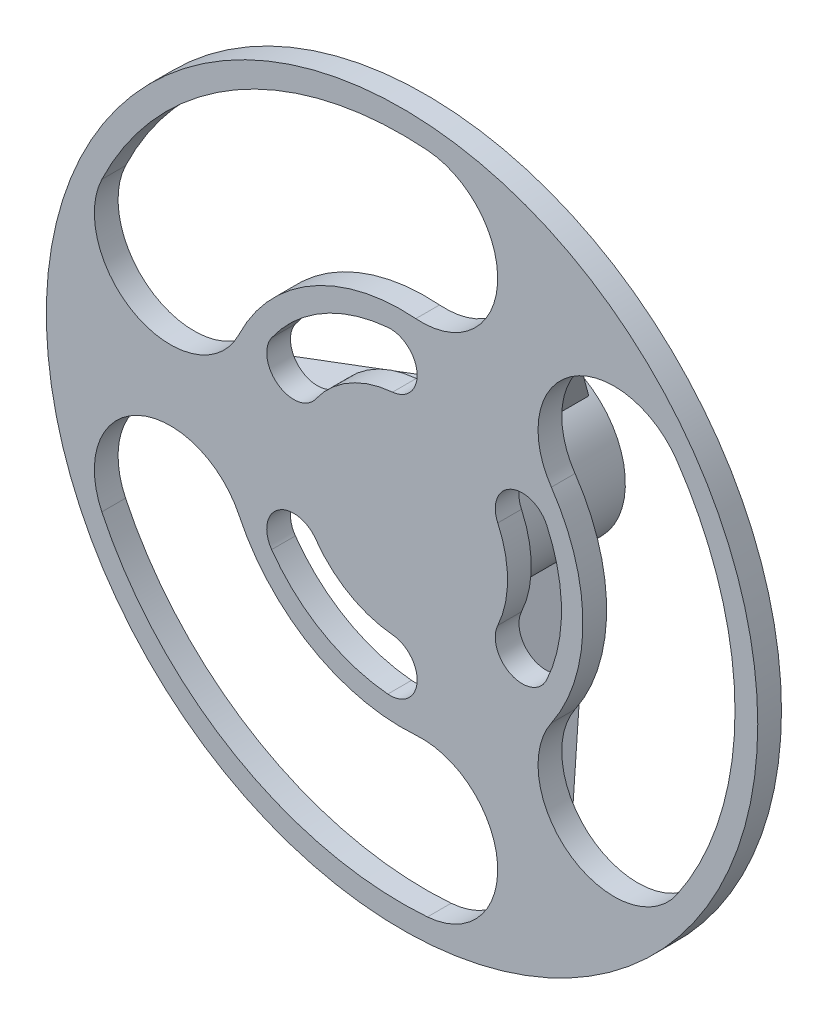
ISO-10303-21;
HEADER;
FILE_DESCRIPTION(('STEP AP214'),'2;1');
FILE_NAME('part.step','',(''),(''),'','','');
FILE_SCHEMA(('AUTOMOTIVE_DESIGN { 1 0 10303 214 1 1 1 1 }'));
ENDSEC;
DATA;
#1=APPLICATION_CONTEXT('core data for automotive mechanical design processes');
#2=APPLICATION_PROTOCOL_DEFINITION('international standard','automotive_design',2000,#1);
#3=PRODUCT_CONTEXT('',#1,'mechanical');
#4=PRODUCT('Part','Part','',(#3));
#5=PRODUCT_RELATED_PRODUCT_CATEGORY('part','',(#4));
#6=PRODUCT_DEFINITION_FORMATION('','',#4);
#7=PRODUCT_DEFINITION_CONTEXT('part definition',#1,'design');
#8=PRODUCT_DEFINITION('design','',#6,#7);
#9=PRODUCT_DEFINITION_SHAPE('','',#8);
#10=(LENGTH_UNIT() NAMED_UNIT(*) SI_UNIT(.MILLI.,.METRE.));
#11=(NAMED_UNIT(*) PLANE_ANGLE_UNIT() SI_UNIT($,.RADIAN.));
#12=(NAMED_UNIT(*) SI_UNIT($,.STERADIAN.) SOLID_ANGLE_UNIT());
#13=UNCERTAINTY_MEASURE_WITH_UNIT(LENGTH_MEASURE(1.E-05),#10,'distance_accuracy_value','');
#14=(GEOMETRIC_REPRESENTATION_CONTEXT(3) GLOBAL_UNCERTAINTY_ASSIGNED_CONTEXT((#13)) GLOBAL_UNIT_ASSIGNED_CONTEXT((#10,
#11,#12)) REPRESENTATION_CONTEXT('',''));
#15=CARTESIAN_POINT('',(0.,0.,0.));
#16=DIRECTION('',(0.,0.,1.));
#17=DIRECTION('',(1.,0.,0.));
#18=AXIS2_PLACEMENT_3D('',#15,#16,#17);
#19=CARTESIAN_POINT('',(0.,0.,0.));
#20=DIRECTION('',(0.,0.,1.));
#21=DIRECTION('',(1.,0.,0.));
#22=AXIS2_PLACEMENT_3D('',#19,#20,#21);
#23=PLANE('',#22);
#24=CARTESIAN_POINT('',(-2.29249355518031E-13,0.,0.));
#25=DIRECTION('',(0.,0.,-1.));
#26=DIRECTION('',(0.499999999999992,0.866025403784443,0.));
#27=AXIS2_PLACEMENT_3D('',#24,#25,#26);
#28=CIRCLE('',#27,20.1684212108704);
#29=CARTESIAN_POINT('',(18.2981133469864,8.48199634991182,0.));
#30=VERTEX_POINT('',#29);
#31=CARTESIAN_POINT('',(18.2981133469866,-8.4819963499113,0.));
#32=VERTEX_POINT('',#31);
#33=EDGE_CURVE('E276',#30,#32,#28,.T.);
#34=ORIENTED_EDGE('',*,*,#33,.F.);
#35=CARTESIAN_POINT('',(15.2042838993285,7.04786761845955,0.));
#36=DIRECTION('',(0.,0.,-1.));
#37=DIRECTION('',(0.499999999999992,0.866025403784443,0.));
#38=AXIS2_PLACEMENT_3D('',#35,#36,#37);
#39=CIRCLE('',#38,3.41005951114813);
#40=CARTESIAN_POINT('',(12.1104544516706,5.61373888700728,0.));
#41=VERTEX_POINT('',#40);
#42=EDGE_CURVE('E50',#41,#30,#39,.T.);
#43=ORIENTED_EDGE('',*,*,#42,.F.);
#44=CARTESIAN_POINT('',(-2.29249355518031E-13,0.,0.));
#45=DIRECTION('',(0.,0.,1.));
#46=DIRECTION('',(0.499999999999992,0.866025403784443,0.));
#47=AXIS2_PLACEMENT_3D('',#44,#45,#46);
#48=CIRCLE('',#47,13.3483021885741);
#49=CARTESIAN_POINT('',(12.1104544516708,-5.61373888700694,0.));
#50=VERTEX_POINT('',#49);
#51=EDGE_CURVE('E267',#50,#41,#48,.T.);
#52=ORIENTED_EDGE('',*,*,#51,.F.);
#53=CARTESIAN_POINT('',(15.2042838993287,-7.04786761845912,0.));
#54=DIRECTION('',(0.,0.,-1.));
#55=DIRECTION('',(0.499999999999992,0.866025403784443,0.));
#56=AXIS2_PLACEMENT_3D('',#53,#54,#55);
#57=CIRCLE('',#56,3.41005951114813);
#58=EDGE_CURVE('E270',#32,#50,#57,.T.);
#59=ORIENTED_EDGE('',*,*,#58,.F.);
#60=EDGE_LOOP('',(#34,#43,#52,#59));
#61=FACE_BOUND('',#60,.T.);
#62=CARTESIAN_POINT('',(-2.26562556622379E-13,0.,0.));
#63=DIRECTION('',(0.,0.,-1.));
#64=DIRECTION('',(0.499999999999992,0.866025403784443,0.));
#65=AXIS2_PLACEMENT_3D('',#62,#63,#64);
#66=CIRCLE('',#65,42.1194255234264);
#67=CARTESIAN_POINT('',(34.7635934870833,23.7810549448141,0.));
#68=VERTEX_POINT('',#67);
#69=CARTESIAN_POINT('',(34.7635934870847,-23.781054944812,0.));
#70=VERTEX_POINT('',#69);
#71=EDGE_CURVE('E301',#68,#70,#66,.T.);
#72=ORIENTED_EDGE('',*,*,#71,.F.);
#73=CARTESIAN_POINT('',(26.8241262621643,18.3498297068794,0.));
#74=DIRECTION('',(0.,0.,-1.));
#75=DIRECTION('',(0.499999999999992,0.866025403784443,0.));
#76=AXIS2_PLACEMENT_3D('',#73,#74,#75);
#77=CIRCLE('',#76,9.61942552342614);
#78=CARTESIAN_POINT('',(18.8846590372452,12.9186044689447,0.));
#79=VERTEX_POINT('',#78);
#80=EDGE_CURVE('E282',#79,#68,#77,.T.);
#81=ORIENTED_EDGE('',*,*,#80,.F.);
#82=CARTESIAN_POINT('',(-2.26562556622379E-13,0.,0.));
#83=DIRECTION('',(0.,0.,1.));
#84=DIRECTION('',(0.499999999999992,0.866025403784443,0.));
#85=AXIS2_PLACEMENT_3D('',#82,#83,#84);
#86=CIRCLE('',#85,22.8805744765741);
#87=CARTESIAN_POINT('',(18.884659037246,-12.9186044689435,0.));
#88=VERTEX_POINT('',#87);
#89=EDGE_CURVE('E290',#88,#79,#86,.T.);
#90=ORIENTED_EDGE('',*,*,#89,.F.);
#91=CARTESIAN_POINT('',(26.8241262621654,-18.3498297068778,0.));
#92=DIRECTION('',(0.,0.,-1.));
#93=DIRECTION('',(0.499999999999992,0.866025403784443,0.));
#94=AXIS2_PLACEMENT_3D('',#91,#92,#93);
#95=CIRCLE('',#94,9.61942552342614);
#96=EDGE_CURVE('E304',#70,#88,#95,.T.);
#97=ORIENTED_EDGE('',*,*,#96,.F.);
#98=EDGE_LOOP('',(#72,#81,#90,#97));
#99=FACE_BOUND('',#98,.T.);
#100=CARTESIAN_POINT('',(1.14283644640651E-13,1.98732661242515E-13,0.));
#101=DIRECTION('',(0.,0.,-1.));
#102=DIRECTION('',(0.500000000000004,-0.866025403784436,0.));
#103=AXIS2_PLACEMENT_3D('',#100,#101,#102);
#104=CIRCLE('',#103,20.1684212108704);
#105=CARTESIAN_POINT('',(-1.80343235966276,-20.0876291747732,0.));
#106=VERTEX_POINT('',#105);
#107=CARTESIAN_POINT('',(-16.4946809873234,-11.6056328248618,0.));
#108=VERTEX_POINT('',#107);
#109=EDGE_CURVE('E333',#106,#108,#104,.T.);
#110=ORIENTED_EDGE('',*,*,#109,.F.);
#111=CARTESIAN_POINT('',(-1.49850954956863,-16.691229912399,0.));
#112=DIRECTION('',(0.,0.,-1.));
#113=DIRECTION('',(0.500000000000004,-0.866025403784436,0.));
#114=AXIS2_PLACEMENT_3D('',#111,#112,#113);
#115=CIRCLE('',#114,3.41005951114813);
#116=CARTESIAN_POINT('',(-1.1935867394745,-13.2948306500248,0.));
#117=VERTEX_POINT('',#116);
#118=EDGE_CURVE('E311',#117,#106,#115,.T.);
#119=ORIENTED_EDGE('',*,*,#118,.F.);
#120=CARTESIAN_POINT('',(1.14283644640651E-13,1.98732661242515E-13,0.));
#121=DIRECTION('',(0.,0.,1.));
#122=DIRECTION('',(0.500000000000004,-0.866025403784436,0.));
#123=AXIS2_PLACEMENT_3D('',#120,#121,#122);
#124=CIRCLE('',#123,13.3483021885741);
#125=CARTESIAN_POINT('',(-10.916867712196,-7.68109176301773,0.));
#126=VERTEX_POINT('',#125);
#127=EDGE_CURVE('E322',#126,#117,#124,.T.);
#128=ORIENTED_EDGE('',*,*,#127,.F.);
#129=CARTESIAN_POINT('',(-13.7057743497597,-9.64336229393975,0.));
#130=DIRECTION('',(0.,0.,-1.));
#131=DIRECTION('',(0.500000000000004,-0.866025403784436,0.));
#132=AXIS2_PLACEMENT_3D('',#129,#130,#131);
#133=CIRCLE('',#132,3.41005951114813);
#134=EDGE_CURVE('E336',#108,#126,#133,.T.);
#135=ORIENTED_EDGE('',*,*,#134,.F.);
#136=EDGE_LOOP('',(#110,#119,#128,#135));
#137=FACE_BOUND('',#136,.T.);
#138=CARTESIAN_POINT('',(1.12940245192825E-13,1.96405825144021E-13,0.));
#139=DIRECTION('',(0.,0.,-1.));
#140=DIRECTION('',(0.500000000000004,-0.866025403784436,0.));
#141=AXIS2_PLACEMENT_3D('',#138,#139,#140);
#142=CIRCLE('',#141,42.1194255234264);
#143=CARTESIAN_POINT('',(3.21320096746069,-41.9966825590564,0.));
#144=VERTEX_POINT('',#143);
#145=CARTESIAN_POINT('',(-37.9767944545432,-18.2156276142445,0.));
#146=VERTEX_POINT('',#145);
#147=EDGE_CURVE('E365',#144,#146,#142,.T.);
#148=ORIENTED_EDGE('',*,*,#147,.F.);
#149=CARTESIAN_POINT('',(2.47935555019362,-32.4052896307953,0.));
#150=DIRECTION('',(0.,0.,-1.));
#151=DIRECTION('',(0.500000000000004,-0.866025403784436,0.));
#152=AXIS2_PLACEMENT_3D('',#149,#150,#151);
#153=CIRCLE('',#152,9.61942552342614);
#154=CARTESIAN_POINT('',(1.74551013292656,-22.8138967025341,0.));
#155=VERTEX_POINT('',#154);
#156=EDGE_CURVE('E343',#155,#144,#153,.T.);
#157=ORIENTED_EDGE('',*,*,#156,.F.);
#158=CARTESIAN_POINT('',(1.12940245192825E-13,1.96405825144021E-13,0.));
#159=DIRECTION('',(0.,0.,1.));
#160=DIRECTION('',(0.500000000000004,-0.866025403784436,0.));
#161=AXIS2_PLACEMENT_3D('',#158,#159,#160);
#162=CIRCLE('',#161,22.8805744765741);
#163=CARTESIAN_POINT('',(-20.6301691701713,-9.89529223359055,0.));
#164=VERTEX_POINT('',#163);
#165=EDGE_CURVE('E354',#164,#155,#162,.T.);
#166=ORIENTED_EDGE('',*,*,#165,.F.);
#167=CARTESIAN_POINT('',(-29.3034818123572,-14.0554599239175,0.));
#168=DIRECTION('',(0.,0.,-1.));
#169=DIRECTION('',(0.500000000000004,-0.866025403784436,0.));
#170=AXIS2_PLACEMENT_3D('',#167,#168,#169);
#171=CIRCLE('',#170,9.61942552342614);
#172=EDGE_CURVE('E368',#146,#164,#171,.T.);
#173=ORIENTED_EDGE('',*,*,#172,.F.);
#174=EDGE_LOOP('',(#148,#157,#166,#173));
#175=FACE_BOUND('',#174,.T.);
#176=CARTESIAN_POINT('',(1.14965710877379E-13,-1.98338870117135E-13,0.));
#177=DIRECTION('',(0.,0.,-1.));
#178=DIRECTION('',(-1.,0.,0.));
#179=AXIS2_PLACEMENT_3D('',#176,#177,#178);
#180=CIRCLE('',#179,20.1684212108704);
#181=CARTESIAN_POINT('',(-16.4946809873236,11.6056328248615,0.));
#182=VERTEX_POINT('',#181);
#183=CARTESIAN_POINT('',(-1.80343235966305,20.0876291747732,0.));
#184=VERTEX_POINT('',#183);
#185=EDGE_CURVE('E397',#182,#184,#180,.T.);
#186=ORIENTED_EDGE('',*,*,#185,.F.);
#187=CARTESIAN_POINT('',(-13.7057743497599,9.64336229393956,0.));
#188=DIRECTION('',(0.,0.,-1.));
#189=DIRECTION('',(-1.,0.,0.));
#190=AXIS2_PLACEMENT_3D('',#187,#188,#189);
#191=CIRCLE('',#190,3.41005951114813);
#192=CARTESIAN_POINT('',(-10.9168677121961,7.68109176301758,0.));
#193=VERTEX_POINT('',#192);
#194=EDGE_CURVE('E375',#193,#182,#191,.T.);
#195=ORIENTED_EDGE('',*,*,#194,.F.);
#196=CARTESIAN_POINT('',(1.14965710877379E-13,-1.98338870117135E-13,0.));
#197=DIRECTION('',(0.,0.,1.));
#198=DIRECTION('',(-1.,0.,0.));
#199=AXIS2_PLACEMENT_3D('',#196,#197,#198);
#200=CIRCLE('',#199,13.3483021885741);
#201=CARTESIAN_POINT('',(-1.19358673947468,13.2948306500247,0.));
#202=VERTEX_POINT('',#201);
#203=EDGE_CURVE('E386',#202,#193,#200,.T.);
#204=ORIENTED_EDGE('',*,*,#203,.F.);
#205=CARTESIAN_POINT('',(-1.49850954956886,16.6912299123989,0.));
#206=DIRECTION('',(0.,0.,-1.));
#207=DIRECTION('',(-1.,0.,0.));
#208=AXIS2_PLACEMENT_3D('',#205,#206,#207);
#209=CIRCLE('',#208,3.41005951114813);
#210=EDGE_CURVE('E400',#184,#202,#209,.T.);
#211=ORIENTED_EDGE('',*,*,#210,.F.);
#212=EDGE_LOOP('',(#186,#195,#204,#211));
#213=FACE_BOUND('',#212,.T.);
#214=CARTESIAN_POINT('',(1.13622311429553E-13,-1.9601203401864E-13,0.));
#215=DIRECTION('',(0.,0.,-1.));
#216=DIRECTION('',(-1.,0.,0.));
#217=AXIS2_PLACEMENT_3D('',#214,#215,#216);
#218=CIRCLE('',#217,42.1194255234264);
#219=CARTESIAN_POINT('',(-37.976794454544,18.2156276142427,0.));
#220=VERTEX_POINT('',#219);
#221=CARTESIAN_POINT('',(3.21320096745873,41.9966825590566,0.));
#222=VERTEX_POINT('',#221);
#223=EDGE_CURVE('E429',#220,#222,#218,.T.);
#224=ORIENTED_EDGE('',*,*,#223,.F.);
#225=CARTESIAN_POINT('',(-29.3034818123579,14.0554599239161,0.));
#226=DIRECTION('',(0.,0.,-1.));
#227=DIRECTION('',(-1.,0.,0.));
#228=AXIS2_PLACEMENT_3D('',#225,#226,#227);
#229=CIRCLE('',#228,9.61942552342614);
#230=CARTESIAN_POINT('',(-20.6301691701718,9.89529223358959,0.));
#231=VERTEX_POINT('',#230);
#232=EDGE_CURVE('E407',#231,#220,#229,.T.);
#233=ORIENTED_EDGE('',*,*,#232,.F.);
#234=CARTESIAN_POINT('',(1.13622311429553E-13,-1.9601203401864E-13,0.));
#235=DIRECTION('',(0.,0.,1.));
#236=DIRECTION('',(-1.,0.,0.));
#237=AXIS2_PLACEMENT_3D('',#234,#235,#236);
#238=CIRCLE('',#237,22.8805744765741);
#239=CARTESIAN_POINT('',(1.7455101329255,22.8138967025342,0.));
#240=VERTEX_POINT('',#239);
#241=EDGE_CURVE('E418',#240,#231,#238,.T.);
#242=ORIENTED_EDGE('',*,*,#241,.F.);
#243=CARTESIAN_POINT('',(2.47935555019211,32.4052896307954,0.));
#244=DIRECTION('',(0.,0.,-1.));
#245=DIRECTION('',(-1.,0.,0.));
#246=AXIS2_PLACEMENT_3D('',#243,#244,#245);
#247=CIRCLE('',#246,9.61942552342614);
#248=EDGE_CURVE('E432',#222,#240,#247,.T.);
#249=ORIENTED_EDGE('',*,*,#248,.F.);
#250=EDGE_LOOP('',(#224,#233,#242,#249));
#251=FACE_BOUND('',#250,.T.);
#252=CARTESIAN_POINT('',(0.,0.,0.));
#253=DIRECTION('',(0.,0.,1.));
#254=DIRECTION('',(1.,0.,0.));
#255=AXIS2_PLACEMENT_3D('',#252,#253,#254);
#256=CIRCLE('',#255,45.);
#257=CARTESIAN_POINT('',(45.,0.,0.));
#258=VERTEX_POINT('',#257);
#259=EDGE_CURVE('E506',#258,#258,#256,.T.);
#260=ORIENTED_EDGE('',*,*,#259,.F.);
#261=EDGE_LOOP('',(#260));
#262=FACE_BOUND('',#261,.T.);
#263=DIRECTION('',(-0.499999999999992,-0.866025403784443,0.));
#264=VECTOR('',#263,1.);
#265=CARTESIAN_POINT('',(18.2843844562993,28.6694828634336,0.));
#266=LINE('',#265,#264);
#267=CARTESIAN_POINT('',(18.2843844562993,28.6694828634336,0.));
#268=VERTEX_POINT('',#267);
#269=CARTESIAN_POINT('',(6.3688630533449,8.0311943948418,0.));
#270=VERTEX_POINT('',#269);
#271=EDGE_CURVE('E448',#268,#270,#266,.T.);
#272=ORIENTED_EDGE('',*,*,#271,.F.);
#273=DIRECTION('',(-0.866025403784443,0.499999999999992,0.));
#274=VECTOR('',#273,1.);
#275=CARTESIAN_POINT('',(18.2843844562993,28.6694828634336,0.));
#276=LINE('',#275,#274);
#277=CARTESIAN_POINT('',(15.6863082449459,30.1694828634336,0.));
#278=VERTEX_POINT('',#277);
#279=EDGE_CURVE('E451',#268,#278,#276,.T.);
#280=ORIENTED_EDGE('',*,*,#279,.T.);
#281=DIRECTION('',(-0.499999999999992,-0.866025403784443,0.));
#282=VECTOR('',#281,1.);
#283=CARTESIAN_POINT('',(15.6863082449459,30.1694828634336,0.));
#284=LINE('',#283,#282);
#285=CARTESIAN_POINT('',(3.77078684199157,9.53119439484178,0.));
#286=VERTEX_POINT('',#285);
#287=EDGE_CURVE('E449',#278,#286,#284,.T.);
#288=ORIENTED_EDGE('',*,*,#287,.T.);
#289=CARTESIAN_POINT('',(0.,0.,0.));
#290=DIRECTION('',(0.,0.,1.));
#291=DIRECTION('',(1.,0.,0.));
#292=AXIS2_PLACEMENT_3D('',#289,#290,#291);
#293=CIRCLE('',#292,10.25);
#294=CARTESIAN_POINT('',(-10.1396498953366,1.5,0.));
#295=VERTEX_POINT('',#294);
#296=EDGE_CURVE('E513',#295,#286,#293,.F.);
#297=ORIENTED_EDGE('',*,*,#296,.F.);
#298=DIRECTION('',(1.,0.,0.));
#299=VECTOR('',#298,1.);
#300=CARTESIAN_POINT('',(-33.9706927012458,1.5,0.));
#301=LINE('',#300,#299);
#302=CARTESIAN_POINT('',(-33.9706927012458,1.5,0.));
#303=VERTEX_POINT('',#302);
#304=EDGE_CURVE('E488',#303,#295,#301,.T.);
#305=ORIENTED_EDGE('',*,*,#304,.F.);
#306=DIRECTION('',(0.,-1.,0.));
#307=VECTOR('',#306,1.);
#308=CARTESIAN_POINT('',(-33.9706927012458,1.5,0.));
#309=LINE('',#308,#307);
#310=CARTESIAN_POINT('',(-33.9706927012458,-1.5,0.));
#311=VERTEX_POINT('',#310);
#312=EDGE_CURVE('E491',#303,#311,#309,.T.);
#313=ORIENTED_EDGE('',*,*,#312,.T.);
#314=DIRECTION('',(1.,0.,0.));
#315=VECTOR('',#314,1.);
#316=CARTESIAN_POINT('',(-33.9706927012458,-1.5,0.));
#317=LINE('',#316,#315);
#318=CARTESIAN_POINT('',(-10.1396498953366,-1.5,0.));
#319=VERTEX_POINT('',#318);
#320=EDGE_CURVE('E489',#311,#319,#317,.T.);
#321=ORIENTED_EDGE('',*,*,#320,.T.);
#322=CARTESIAN_POINT('',(3.7707868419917,-9.53119439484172,0.));
#323=VERTEX_POINT('',#322);
#324=EDGE_CURVE('E510',#323,#319,#293,.F.);
#325=ORIENTED_EDGE('',*,*,#324,.F.);
#326=DIRECTION('',(-0.500000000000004,0.866025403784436,0.));
#327=VECTOR('',#326,1.);
#328=CARTESIAN_POINT('',(15.6863082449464,-30.1694828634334,0.));
#329=LINE('',#328,#327);
#330=CARTESIAN_POINT('',(15.6863082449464,-30.1694828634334,0.));
#331=VERTEX_POINT('',#330);
#332=EDGE_CURVE('E468',#331,#323,#329,.T.);
#333=ORIENTED_EDGE('',*,*,#332,.F.);
#334=DIRECTION('',(0.866025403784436,0.500000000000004,0.));
#335=VECTOR('',#334,1.);
#336=CARTESIAN_POINT('',(15.6863082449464,-30.1694828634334,0.));
#337=LINE('',#336,#335);
#338=CARTESIAN_POINT('',(18.2843844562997,-28.6694828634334,0.));
#339=VERTEX_POINT('',#338);
#340=EDGE_CURVE('E471',#331,#339,#337,.T.);
#341=ORIENTED_EDGE('',*,*,#340,.T.);
#342=DIRECTION('',(-0.500000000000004,0.866025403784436,0.));
#343=VECTOR('',#342,1.);
#344=CARTESIAN_POINT('',(18.2843844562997,-28.6694828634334,0.));
#345=LINE('',#344,#343);
#346=CARTESIAN_POINT('',(6.368863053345,-8.03119439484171,0.));
#347=VERTEX_POINT('',#346);
#348=EDGE_CURVE('E469',#339,#347,#345,.T.);
#349=ORIENTED_EDGE('',*,*,#348,.T.);
#350=EDGE_CURVE('E517',#270,#347,#293,.F.);
#351=ORIENTED_EDGE('',*,*,#350,.F.);
#352=EDGE_LOOP('',(#272,#280,#288,#297,#305,#313,#321,#325,#333,#341,#349,#351));
#353=FACE_BOUND('',#352,.T.);
#354=ADVANCED_FACE('F35',(#61,#99,#137,#175,#213,#251,#262,#353),#23,.F.);
#355=CARTESIAN_POINT('',(0.,0.,-15.));
#356=DIRECTION('',(0.,0.,1.));
#357=DIRECTION('',(1.,0.,0.));
#358=AXIS2_PLACEMENT_3D('',#355,#356,#357);
#359=CYLINDRICAL_SURFACE('',#358,10.25);
#360=CARTESIAN_POINT('',(0.,0.,-15.));
#361=DIRECTION('',(0.,0.,-1.));
#362=DIRECTION('',(-1.,0.,0.));
#363=AXIS2_PLACEMENT_3D('',#360,#361,#362);
#364=CIRCLE('',#363,10.25);
#365=CARTESIAN_POINT('',(-10.25,0.,-15.));
#366=VERTEX_POINT('',#365);
#367=EDGE_CURVE('E501',#366,#366,#364,.T.);
#368=ORIENTED_EDGE('',*,*,#367,.F.);
#369=EDGE_LOOP('',(#368));
#370=FACE_BOUND('',#369,.T.);
#371=DIRECTION('',(0.,0.,1.));
#372=VECTOR('',#371,1.);
#373=CARTESIAN_POINT('',(6.3688630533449,8.0311943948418,-15.));
#374=LINE('',#373,#372);
#375=CARTESIAN_POINT('',(6.36886305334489,8.0311943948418,-14.2533404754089));
#376=VERTEX_POINT('',#375);
#377=EDGE_CURVE('E460',#270,#376,#374,.F.);
#378=ORIENTED_EDGE('',*,*,#377,.F.);
#379=ORIENTED_EDGE('',*,*,#350,.T.);
#380=DIRECTION('',(0.,0.,1.));
#381=VECTOR('',#380,1.);
#382=CARTESIAN_POINT('',(6.36886305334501,-8.03119439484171,-15.));
#383=LINE('',#382,#381);
#384=CARTESIAN_POINT('',(6.36886305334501,-8.03119439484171,-14.2533404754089));
#385=VERTEX_POINT('',#384);
#386=EDGE_CURVE('E477',#347,#385,#383,.F.);
#387=ORIENTED_EDGE('',*,*,#386,.T.);
#388=CARTESIAN_POINT('',(0.,0.,-20.317862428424));
#389=DIRECTION('',(-0.256648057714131,0.444527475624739,0.858211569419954));
#390=DIRECTION('',(0.429105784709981,-0.743233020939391,0.513296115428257));
#391=AXIS2_PLACEMENT_3D('',#388,#389,#390);
#392=ELLIPSE('',#391,11.9434418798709,10.25);
#393=CARTESIAN_POINT('',(3.7707868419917,-9.53119439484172,-14.2533404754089));
#394=VERTEX_POINT('',#393);
#395=EDGE_CURVE('E482',#394,#385,#392,.T.);
#396=ORIENTED_EDGE('',*,*,#395,.F.);
#397=DIRECTION('',(0.,0.,1.));
#398=VECTOR('',#397,1.);
#399=CARTESIAN_POINT('',(3.7707868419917,-9.53119439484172,-15.));
#400=LINE('',#399,#398);
#401=EDGE_CURVE('E480',#323,#394,#400,.F.);
#402=ORIENTED_EDGE('',*,*,#401,.F.);
#403=ORIENTED_EDGE('',*,*,#324,.T.);
#404=DIRECTION('',(0.,0.,1.));
#405=VECTOR('',#404,1.);
#406=CARTESIAN_POINT('',(-10.1396498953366,-1.5,-15.));
#407=LINE('',#406,#405);
#408=CARTESIAN_POINT('',(-10.1396498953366,-1.5,-14.2533404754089));
#409=VERTEX_POINT('',#408);
#410=EDGE_CURVE('E516',#319,#409,#407,.F.);
#411=ORIENTED_EDGE('',*,*,#410,.T.);
#412=CARTESIAN_POINT('',(0.,0.,-20.317862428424));
#413=DIRECTION('',(0.513296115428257,0.,0.858211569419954));
#414=DIRECTION('',(-0.858211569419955,0.,0.513296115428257));
#415=AXIS2_PLACEMENT_3D('',#412,#413,#414);
#416=ELLIPSE('',#415,11.9434418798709,10.25);
#417=CARTESIAN_POINT('',(-10.1396498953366,1.5,-14.2533404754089));
#418=VERTEX_POINT('',#417);
#419=EDGE_CURVE('E43',#418,#409,#416,.T.);
#420=ORIENTED_EDGE('',*,*,#419,.F.);
#421=DIRECTION('',(0.,0.,1.));
#422=VECTOR('',#421,1.);
#423=CARTESIAN_POINT('',(-10.1396498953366,1.5,-15.));
#424=LINE('',#423,#422);
#425=EDGE_CURVE('E11',#295,#418,#424,.F.);
#426=ORIENTED_EDGE('',*,*,#425,.F.);
#427=ORIENTED_EDGE('',*,*,#296,.T.);
#428=DIRECTION('',(0.,0.,1.));
#429=VECTOR('',#428,1.);
#430=CARTESIAN_POINT('',(3.77078684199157,9.53119439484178,-15.));
#431=LINE('',#430,#429);
#432=CARTESIAN_POINT('',(3.77078684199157,9.53119439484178,-14.2533404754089));
#433=VERTEX_POINT('',#432);
#434=EDGE_CURVE('E457',#286,#433,#431,.F.);
#435=ORIENTED_EDGE('',*,*,#434,.T.);
#436=CARTESIAN_POINT('',(0.,0.,-20.317862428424));
#437=DIRECTION('',(-0.256648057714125,-0.444527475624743,0.858211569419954));
#438=DIRECTION('',(0.42910578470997,0.743233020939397,0.513296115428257));
#439=AXIS2_PLACEMENT_3D('',#436,#437,#438);
#440=ELLIPSE('',#439,11.9434418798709,10.25);
#441=EDGE_CURVE('E462',#376,#433,#440,.T.);
#442=ORIENTED_EDGE('',*,*,#441,.F.);
#443=EDGE_LOOP('',(#378,#379,#387,#396,#402,#403,#411,#420,#426,#427,#435,#442));
#444=FACE_BOUND('',#443,.T.);
#445=ADVANCED_FACE('F530',(#370,#444),#359,.T.);
#446=CARTESIAN_POINT('',(0.,0.,3.));
#447=DIRECTION('',(0.,0.,-1.));
#448=DIRECTION('',(-1.,0.,0.));
#449=AXIS2_PLACEMENT_3D('',#446,#447,#448);
#450=CYLINDRICAL_SURFACE('',#449,45.);
#451=CARTESIAN_POINT('',(0.,0.,3.));
#452=DIRECTION('',(0.,0.,1.));
#453=DIRECTION('',(1.,0.,0.));
#454=AXIS2_PLACEMENT_3D('',#451,#452,#453);
#455=CIRCLE('',#454,45.);
#456=CARTESIAN_POINT('',(45.,0.,3.));
#457=VERTEX_POINT('',#456);
#458=EDGE_CURVE('E507',#457,#457,#455,.T.);
#459=ORIENTED_EDGE('',*,*,#458,.F.);
#460=EDGE_LOOP('',(#459));
#461=FACE_BOUND('',#460,.T.);
#462=ORIENTED_EDGE('',*,*,#259,.T.);
#463=EDGE_LOOP('',(#462));
#464=FACE_BOUND('',#463,.T.);
#465=ADVANCED_FACE('F37',(#461,#464),#450,.T.);
#466=CARTESIAN_POINT('',(0.,0.,3.));
#467=DIRECTION('',(0.,0.,1.));
#468=DIRECTION('',(1.,0.,0.));
#469=AXIS2_PLACEMENT_3D('',#466,#467,#468);
#470=PLANE('',#469);
#471=CARTESIAN_POINT('',(15.2042838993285,7.04786761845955,3.));
#472=DIRECTION('',(0.,0.,-1.));
#473=DIRECTION('',(0.499999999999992,0.866025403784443,0.));
#474=AXIS2_PLACEMENT_3D('',#471,#472,#473);
#475=CIRCLE('',#474,3.41005951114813);
#476=CARTESIAN_POINT('',(12.1104544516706,5.61373888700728,3.));
#477=VERTEX_POINT('',#476);
#478=CARTESIAN_POINT('',(18.2981133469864,8.48199634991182,3.));
#479=VERTEX_POINT('',#478);
#480=EDGE_CURVE('E251',#477,#479,#475,.T.);
#481=ORIENTED_EDGE('',*,*,#480,.T.);
#482=CARTESIAN_POINT('',(-2.29249355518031E-13,0.,3.));
#483=DIRECTION('',(0.,0.,-1.));
#484=DIRECTION('',(0.499999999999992,0.866025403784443,0.));
#485=AXIS2_PLACEMENT_3D('',#482,#483,#484);
#486=CIRCLE('',#485,20.1684212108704);
#487=CARTESIAN_POINT('',(18.2981133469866,-8.4819963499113,3.));
#488=VERTEX_POINT('',#487);
#489=EDGE_CURVE('E260',#479,#488,#486,.T.);
#490=ORIENTED_EDGE('',*,*,#489,.T.);
#491=CARTESIAN_POINT('',(15.2042838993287,-7.04786761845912,3.));
#492=DIRECTION('',(0.,0.,-1.));
#493=DIRECTION('',(0.499999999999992,0.866025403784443,0.));
#494=AXIS2_PLACEMENT_3D('',#491,#492,#493);
#495=CIRCLE('',#494,3.41005951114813);
#496=CARTESIAN_POINT('',(12.1104544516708,-5.61373888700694,3.));
#497=VERTEX_POINT('',#496);
#498=EDGE_CURVE('E58',#488,#497,#495,.T.);
#499=ORIENTED_EDGE('',*,*,#498,.T.);
#500=CARTESIAN_POINT('',(-2.29249355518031E-13,0.,3.));
#501=DIRECTION('',(0.,0.,1.));
#502=DIRECTION('',(0.499999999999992,0.866025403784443,0.));
#503=AXIS2_PLACEMENT_3D('',#500,#501,#502);
#504=CIRCLE('',#503,13.3483021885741);
#505=EDGE_CURVE('E257',#497,#477,#504,.T.);
#506=ORIENTED_EDGE('',*,*,#505,.T.);
#507=EDGE_LOOP('',(#481,#490,#499,#506));
#508=FACE_BOUND('',#507,.T.);
#509=CARTESIAN_POINT('',(26.8241262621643,18.3498297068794,3.));
#510=DIRECTION('',(0.,0.,-1.));
#511=DIRECTION('',(0.499999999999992,0.866025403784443,0.));
#512=AXIS2_PLACEMENT_3D('',#509,#510,#511);
#513=CIRCLE('',#512,9.61942552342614);
#514=CARTESIAN_POINT('',(18.8846590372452,12.9186044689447,3.));
#515=VERTEX_POINT('',#514);
#516=CARTESIAN_POINT('',(34.7635934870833,23.7810549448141,3.));
#517=VERTEX_POINT('',#516);
#518=EDGE_CURVE('E286',#515,#517,#513,.T.);
#519=ORIENTED_EDGE('',*,*,#518,.T.);
#520=CARTESIAN_POINT('',(-2.26562556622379E-13,0.,3.));
#521=DIRECTION('',(0.,0.,-1.));
#522=DIRECTION('',(0.499999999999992,0.866025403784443,0.));
#523=AXIS2_PLACEMENT_3D('',#520,#521,#522);
#524=CIRCLE('',#523,42.1194255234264);
#525=CARTESIAN_POINT('',(34.7635934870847,-23.781054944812,3.));
#526=VERTEX_POINT('',#525);
#527=EDGE_CURVE('E289',#517,#526,#524,.T.);
#528=ORIENTED_EDGE('',*,*,#527,.T.);
#529=CARTESIAN_POINT('',(26.8241262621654,-18.3498297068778,3.));
#530=DIRECTION('',(0.,0.,-1.));
#531=DIRECTION('',(0.499999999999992,0.866025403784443,0.));
#532=AXIS2_PLACEMENT_3D('',#529,#530,#531);
#533=CIRCLE('',#532,9.61942552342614);
#534=CARTESIAN_POINT('',(18.884659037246,-12.9186044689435,3.));
#535=VERTEX_POINT('',#534);
#536=EDGE_CURVE('E293',#526,#535,#533,.T.);
#537=ORIENTED_EDGE('',*,*,#536,.T.);
#538=CARTESIAN_POINT('',(-2.26562556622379E-13,0.,3.));
#539=DIRECTION('',(0.,0.,1.));
#540=DIRECTION('',(0.499999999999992,0.866025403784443,0.));
#541=AXIS2_PLACEMENT_3D('',#538,#539,#540);
#542=CIRCLE('',#541,22.8805744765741);
#543=EDGE_CURVE('E296',#535,#515,#542,.T.);
#544=ORIENTED_EDGE('',*,*,#543,.T.);
#545=EDGE_LOOP('',(#519,#528,#537,#544));
#546=FACE_BOUND('',#545,.T.);
#547=CARTESIAN_POINT('',(-1.49850954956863,-16.691229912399,3.));
#548=DIRECTION('',(0.,0.,-1.));
#549=DIRECTION('',(0.500000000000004,-0.866025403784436,0.));
#550=AXIS2_PLACEMENT_3D('',#547,#548,#549);
#551=CIRCLE('',#550,3.41005951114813);
#552=CARTESIAN_POINT('',(-1.1935867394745,-13.2948306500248,3.));
#553=VERTEX_POINT('',#552);
#554=CARTESIAN_POINT('',(-1.80343235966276,-20.0876291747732,3.));
#555=VERTEX_POINT('',#554);
#556=EDGE_CURVE('E318',#553,#555,#551,.T.);
#557=ORIENTED_EDGE('',*,*,#556,.T.);
#558=CARTESIAN_POINT('',(1.14283644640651E-13,1.98732661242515E-13,3.));
#559=DIRECTION('',(0.,0.,-1.));
#560=DIRECTION('',(0.500000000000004,-0.866025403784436,0.));
#561=AXIS2_PLACEMENT_3D('',#558,#559,#560);
#562=CIRCLE('',#561,20.1684212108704);
#563=CARTESIAN_POINT('',(-16.4946809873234,-11.6056328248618,3.));
#564=VERTEX_POINT('',#563);
#565=EDGE_CURVE('E321',#555,#564,#562,.T.);
#566=ORIENTED_EDGE('',*,*,#565,.T.);
#567=CARTESIAN_POINT('',(-13.7057743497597,-9.64336229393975,3.));
#568=DIRECTION('',(0.,0.,-1.));
#569=DIRECTION('',(0.500000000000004,-0.866025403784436,0.));
#570=AXIS2_PLACEMENT_3D('',#567,#568,#569);
#571=CIRCLE('',#570,3.41005951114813);
#572=CARTESIAN_POINT('',(-10.916867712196,-7.68109176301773,3.));
#573=VERTEX_POINT('',#572);
#574=EDGE_CURVE('E325',#564,#573,#571,.T.);
#575=ORIENTED_EDGE('',*,*,#574,.T.);
#576=CARTESIAN_POINT('',(1.14283644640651E-13,1.98732661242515E-13,3.));
#577=DIRECTION('',(0.,0.,1.));
#578=DIRECTION('',(0.500000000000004,-0.866025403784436,0.));
#579=AXIS2_PLACEMENT_3D('',#576,#577,#578);
#580=CIRCLE('',#579,13.3483021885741);
#581=EDGE_CURVE('E328',#573,#553,#580,.T.);
#582=ORIENTED_EDGE('',*,*,#581,.T.);
#583=EDGE_LOOP('',(#557,#566,#575,#582));
#584=FACE_BOUND('',#583,.T.);
#585=CARTESIAN_POINT('',(2.47935555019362,-32.4052896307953,3.));
#586=DIRECTION('',(0.,0.,-1.));
#587=DIRECTION('',(0.500000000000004,-0.866025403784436,0.));
#588=AXIS2_PLACEMENT_3D('',#585,#586,#587);
#589=CIRCLE('',#588,9.61942552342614);
#590=CARTESIAN_POINT('',(1.74551013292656,-22.8138967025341,3.));
#591=VERTEX_POINT('',#590);
#592=CARTESIAN_POINT('',(3.21320096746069,-41.9966825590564,3.));
#593=VERTEX_POINT('',#592);
#594=EDGE_CURVE('E350',#591,#593,#589,.T.);
#595=ORIENTED_EDGE('',*,*,#594,.T.);
#596=CARTESIAN_POINT('',(1.12940245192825E-13,1.96405825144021E-13,3.));
#597=DIRECTION('',(0.,0.,-1.));
#598=DIRECTION('',(0.500000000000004,-0.866025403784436,0.));
#599=AXIS2_PLACEMENT_3D('',#596,#597,#598);
#600=CIRCLE('',#599,42.1194255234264);
#601=CARTESIAN_POINT('',(-37.9767944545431,-18.2156276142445,3.));
#602=VERTEX_POINT('',#601);
#603=EDGE_CURVE('E353',#593,#602,#600,.T.);
#604=ORIENTED_EDGE('',*,*,#603,.T.);
#605=CARTESIAN_POINT('',(-29.3034818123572,-14.0554599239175,3.));
#606=DIRECTION('',(0.,0.,-1.));
#607=DIRECTION('',(0.500000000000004,-0.866025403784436,0.));
#608=AXIS2_PLACEMENT_3D('',#605,#606,#607);
#609=CIRCLE('',#608,9.61942552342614);
#610=CARTESIAN_POINT('',(-20.6301691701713,-9.89529223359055,3.));
#611=VERTEX_POINT('',#610);
#612=EDGE_CURVE('E357',#602,#611,#609,.T.);
#613=ORIENTED_EDGE('',*,*,#612,.T.);
#614=CARTESIAN_POINT('',(1.12940245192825E-13,1.96405825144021E-13,3.));
#615=DIRECTION('',(0.,0.,1.));
#616=DIRECTION('',(0.500000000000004,-0.866025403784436,0.));
#617=AXIS2_PLACEMENT_3D('',#614,#615,#616);
#618=CIRCLE('',#617,22.8805744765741);
#619=EDGE_CURVE('E360',#611,#591,#618,.T.);
#620=ORIENTED_EDGE('',*,*,#619,.T.);
#621=EDGE_LOOP('',(#595,#604,#613,#620));
#622=FACE_BOUND('',#621,.T.);
#623=CARTESIAN_POINT('',(-13.7057743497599,9.64336229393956,3.));
#624=DIRECTION('',(0.,0.,-1.));
#625=DIRECTION('',(-1.,0.,0.));
#626=AXIS2_PLACEMENT_3D('',#623,#624,#625);
#627=CIRCLE('',#626,3.41005951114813);
#628=CARTESIAN_POINT('',(-10.9168677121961,7.68109176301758,3.));
#629=VERTEX_POINT('',#628);
#630=CARTESIAN_POINT('',(-16.4946809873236,11.6056328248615,3.));
#631=VERTEX_POINT('',#630);
#632=EDGE_CURVE('E382',#629,#631,#627,.T.);
#633=ORIENTED_EDGE('',*,*,#632,.T.);
#634=CARTESIAN_POINT('',(1.14965710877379E-13,-1.98338870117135E-13,3.));
#635=DIRECTION('',(0.,0.,-1.));
#636=DIRECTION('',(-1.,0.,0.));
#637=AXIS2_PLACEMENT_3D('',#634,#635,#636);
#638=CIRCLE('',#637,20.1684212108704);
#639=CARTESIAN_POINT('',(-1.80343235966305,20.0876291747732,3.));
#640=VERTEX_POINT('',#639);
#641=EDGE_CURVE('E385',#631,#640,#638,.T.);
#642=ORIENTED_EDGE('',*,*,#641,.T.);
#643=CARTESIAN_POINT('',(-1.49850954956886,16.6912299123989,3.));
#644=DIRECTION('',(0.,0.,-1.));
#645=DIRECTION('',(-1.,0.,0.));
#646=AXIS2_PLACEMENT_3D('',#643,#644,#645);
#647=CIRCLE('',#646,3.41005951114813);
#648=CARTESIAN_POINT('',(-1.19358673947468,13.2948306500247,3.));
#649=VERTEX_POINT('',#648);
#650=EDGE_CURVE('E389',#640,#649,#647,.T.);
#651=ORIENTED_EDGE('',*,*,#650,.T.);
#652=CARTESIAN_POINT('',(1.14965710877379E-13,-1.98338870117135E-13,3.));
#653=DIRECTION('',(0.,0.,1.));
#654=DIRECTION('',(-1.,0.,0.));
#655=AXIS2_PLACEMENT_3D('',#652,#653,#654);
#656=CIRCLE('',#655,13.3483021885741);
#657=EDGE_CURVE('E392',#649,#629,#656,.T.);
#658=ORIENTED_EDGE('',*,*,#657,.T.);
#659=EDGE_LOOP('',(#633,#642,#651,#658));
#660=FACE_BOUND('',#659,.T.);
#661=CARTESIAN_POINT('',(-29.3034818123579,14.0554599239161,3.));
#662=DIRECTION('',(0.,0.,-1.));
#663=DIRECTION('',(-1.,0.,0.));
#664=AXIS2_PLACEMENT_3D('',#661,#662,#663);
#665=CIRCLE('',#664,9.61942552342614);
#666=CARTESIAN_POINT('',(-20.6301691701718,9.89529223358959,3.));
#667=VERTEX_POINT('',#666);
#668=CARTESIAN_POINT('',(-37.976794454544,18.2156276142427,3.));
#669=VERTEX_POINT('',#668);
#670=EDGE_CURVE('E414',#667,#669,#665,.T.);
#671=ORIENTED_EDGE('',*,*,#670,.T.);
#672=CARTESIAN_POINT('',(1.13622311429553E-13,-1.9601203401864E-13,3.));
#673=DIRECTION('',(0.,0.,-1.));
#674=DIRECTION('',(-1.,0.,0.));
#675=AXIS2_PLACEMENT_3D('',#672,#673,#674);
#676=CIRCLE('',#675,42.1194255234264);
#677=CARTESIAN_POINT('',(3.21320096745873,41.9966825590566,3.));
#678=VERTEX_POINT('',#677);
#679=EDGE_CURVE('E417',#669,#678,#676,.T.);
#680=ORIENTED_EDGE('',*,*,#679,.T.);
#681=CARTESIAN_POINT('',(2.47935555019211,32.4052896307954,3.));
#682=DIRECTION('',(0.,0.,-1.));
#683=DIRECTION('',(-1.,0.,0.));
#684=AXIS2_PLACEMENT_3D('',#681,#682,#683);
#685=CIRCLE('',#684,9.61942552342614);
#686=CARTESIAN_POINT('',(1.7455101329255,22.8138967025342,3.));
#687=VERTEX_POINT('',#686);
#688=EDGE_CURVE('E421',#678,#687,#685,.T.);
#689=ORIENTED_EDGE('',*,*,#688,.T.);
#690=CARTESIAN_POINT('',(1.13622311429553E-13,-1.9601203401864E-13,3.));
#691=DIRECTION('',(0.,0.,1.));
#692=DIRECTION('',(-1.,0.,0.));
#693=AXIS2_PLACEMENT_3D('',#690,#691,#692);
#694=CIRCLE('',#693,22.8805744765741);
#695=EDGE_CURVE('E424',#687,#667,#694,.T.);
#696=ORIENTED_EDGE('',*,*,#695,.T.);
#697=EDGE_LOOP('',(#671,#680,#689,#696));
#698=FACE_BOUND('',#697,.T.);
#699=ORIENTED_EDGE('',*,*,#458,.T.);
#700=EDGE_LOOP('',(#699));
#701=FACE_BOUND('',#700,.T.);
#702=ADVANCED_FACE('F264',(#508,#546,#584,#622,#660,#698,#701),#470,.T.);
#703=CARTESIAN_POINT('',(0.,0.,-15.));
#704=DIRECTION('',(0.,0.,-1.));
#705=DIRECTION('',(-1.,0.,0.));
#706=AXIS2_PLACEMENT_3D('',#703,#704,#705);
#707=PLANE('',#706);
#708=ORIENTED_EDGE('',*,*,#367,.T.);
#709=EDGE_LOOP('',(#708));
#710=FACE_BOUND('',#709,.T.);
#711=CARTESIAN_POINT('',(0.,0.,-15.));
#712=DIRECTION('',(0.,0.,-1.));
#713=DIRECTION('',(-1.,0.,0.));
#714=AXIS2_PLACEMENT_3D('',#711,#712,#713);
#715=CIRCLE('',#714,7.25);
#716=CARTESIAN_POINT('',(-7.25,0.,-15.));
#717=VERTEX_POINT('',#716);
#718=EDGE_CURVE('E498',#717,#717,#715,.T.);
#719=ORIENTED_EDGE('',*,*,#718,.F.);
#720=EDGE_LOOP('',(#719));
#721=FACE_BOUND('',#720,.T.);
#722=ADVANCED_FACE('F591',(#710,#721),#707,.T.);
#723=CARTESIAN_POINT('',(0.,0.,-15.));
#724=DIRECTION('',(0.,0.,1.));
#725=DIRECTION('',(1.,0.,0.));
#726=AXIS2_PLACEMENT_3D('',#723,#724,#725);
#727=CYLINDRICAL_SURFACE('',#726,7.25);
#728=ORIENTED_EDGE('',*,*,#718,.T.);
#729=EDGE_LOOP('',(#728));
#730=FACE_BOUND('',#729,.T.);
#731=CARTESIAN_POINT('',(0.,0.,0.));
#732=DIRECTION('',(0.,0.,-1.));
#733=DIRECTION('',(-1.,0.,0.));
#734=AXIS2_PLACEMENT_3D('',#731,#732,#733);
#735=CIRCLE('',#734,7.25);
#736=CARTESIAN_POINT('',(-7.25,0.,0.));
#737=VERTEX_POINT('',#736);
#738=EDGE_CURVE('E497',#737,#737,#735,.T.);
#739=ORIENTED_EDGE('',*,*,#738,.F.);
#740=EDGE_LOOP('',(#739));
#741=FACE_BOUND('',#740,.T.);
#742=ADVANCED_FACE('F584',(#730,#741),#727,.F.);
#743=ORIENTED_EDGE('',*,*,#738,.T.);
#744=EDGE_LOOP('',(#743));
#745=FACE_BOUND('',#744,.T.);
#746=ADVANCED_FACE('F575',(#745),#23,.F.);
#747=CARTESIAN_POINT('',(-8.89126358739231,1.5,-15.));
#748=DIRECTION('',(0.513296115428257,0.,0.858211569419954));
#749=DIRECTION('',(0.858211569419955,0.,-0.513296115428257));
#750=AXIS2_PLACEMENT_3D('',#747,#748,#749);
#751=PLANE('',#750);
#752=DIRECTION('',(-0.858211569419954,0.,0.513296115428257));
#753=VECTOR('',#752,1.);
#754=CARTESIAN_POINT('',(-8.89126358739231,1.5,-15.));
#755=LINE('',#754,#753);
#756=EDGE_CURVE('E486',#418,#303,#755,.T.);
#757=ORIENTED_EDGE('',*,*,#756,.F.);
#758=ORIENTED_EDGE('',*,*,#419,.T.);
#759=DIRECTION('',(-0.858211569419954,0.,0.513296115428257));
#760=VECTOR('',#759,1.);
#761=CARTESIAN_POINT('',(-8.89126358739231,-1.5,-15.));
#762=LINE('',#761,#760);
#763=EDGE_CURVE('E485',#409,#311,#762,.T.);
#764=ORIENTED_EDGE('',*,*,#763,.T.);
#765=ORIENTED_EDGE('',*,*,#312,.F.);
#766=EDGE_LOOP('',(#757,#758,#764,#765));
#767=FACE_BOUND('',#766,.T.);
#768=ADVANCED_FACE('F523',(#767),#751,.F.);
#769=CARTESIAN_POINT('',(0.,1.5,0.));
#770=DIRECTION('',(0.,-1.,0.));
#771=DIRECTION('',(0.,0.,-1.));
#772=AXIS2_PLACEMENT_3D('',#769,#770,#771);
#773=PLANE('',#772);
#774=ORIENTED_EDGE('',*,*,#304,.T.);
#775=ORIENTED_EDGE('',*,*,#425,.T.);
#776=ORIENTED_EDGE('',*,*,#756,.T.);
#777=EDGE_LOOP('',(#774,#775,#776));
#778=FACE_BOUND('',#777,.T.);
#779=ADVANCED_FACE('F541',(#778),#773,.F.);
#780=CARTESIAN_POINT('',(0.,-1.5,0.));
#781=DIRECTION('',(0.,-1.,0.));
#782=DIRECTION('',(0.,0.,-1.));
#783=AXIS2_PLACEMENT_3D('',#780,#781,#782);
#784=PLANE('',#783);
#785=ORIENTED_EDGE('',*,*,#410,.F.);
#786=ORIENTED_EDGE('',*,*,#320,.F.);
#787=ORIENTED_EDGE('',*,*,#763,.F.);
#788=EDGE_LOOP('',(#785,#786,#787));
#789=FACE_BOUND('',#788,.T.);
#790=ADVANCED_FACE('F534',(#789),#784,.T.);
#791=CARTESIAN_POINT('',(3.14659368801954,-8.45006013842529,-15.));
#792=DIRECTION('',(-0.256648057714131,0.444527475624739,0.858211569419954));
#793=DIRECTION('',(0.,-0.887953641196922,0.459932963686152));
#794=AXIS2_PLACEMENT_3D('',#791,#792,#793);
#795=PLANE('',#794);
#796=DIRECTION('',(0.429105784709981,-0.743233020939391,0.513296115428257));
#797=VECTOR('',#796,1.);
#798=CARTESIAN_POINT('',(3.14659368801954,-8.45006013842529,-15.));
#799=LINE('',#798,#797);
#800=EDGE_CURVE('E466',#394,#331,#799,.T.);
#801=ORIENTED_EDGE('',*,*,#800,.F.);
#802=ORIENTED_EDGE('',*,*,#395,.T.);
#803=DIRECTION('',(0.429105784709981,-0.743233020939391,0.513296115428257));
#804=VECTOR('',#803,1.);
#805=CARTESIAN_POINT('',(5.74466989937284,-6.95006013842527,-15.));
#806=LINE('',#805,#804);
#807=EDGE_CURVE('E465',#385,#339,#806,.T.);
#808=ORIENTED_EDGE('',*,*,#807,.T.);
#809=ORIENTED_EDGE('',*,*,#340,.F.);
#810=EDGE_LOOP('',(#801,#802,#808,#809));
#811=FACE_BOUND('',#810,.T.);
#812=ADVANCED_FACE('F561',(#811),#795,.F.);
#813=CARTESIAN_POINT('',(-1.29903810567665,-0.750000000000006,0.));
#814=DIRECTION('',(0.866025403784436,0.500000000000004,0.));
#815=DIRECTION('',(0.,0.,-1.));
#816=AXIS2_PLACEMENT_3D('',#813,#814,#815);
#817=PLANE('',#816);
#818=ORIENTED_EDGE('',*,*,#332,.T.);
#819=ORIENTED_EDGE('',*,*,#401,.T.);
#820=ORIENTED_EDGE('',*,*,#800,.T.);
#821=EDGE_LOOP('',(#818,#819,#820));
#822=FACE_BOUND('',#821,.T.);
#823=ADVANCED_FACE('F563',(#822),#817,.F.);
#824=CARTESIAN_POINT('',(1.29903810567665,0.750000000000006,0.));
#825=DIRECTION('',(0.866025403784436,0.500000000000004,0.));
#826=DIRECTION('',(0.,0.,-1.));
#827=AXIS2_PLACEMENT_3D('',#824,#825,#826);
#828=PLANE('',#827);
#829=ORIENTED_EDGE('',*,*,#386,.F.);
#830=ORIENTED_EDGE('',*,*,#348,.F.);
#831=ORIENTED_EDGE('',*,*,#807,.F.);
#832=EDGE_LOOP('',(#829,#830,#831));
#833=FACE_BOUND('',#832,.T.);
#834=ADVANCED_FACE('F557',(#833),#828,.T.);
#835=CARTESIAN_POINT('',(5.74466989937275,6.95006013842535,-15.));
#836=DIRECTION('',(-0.256648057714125,-0.444527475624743,0.858211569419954));
#837=DIRECTION('',(0.,-0.887953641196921,-0.459932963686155));
#838=AXIS2_PLACEMENT_3D('',#835,#836,#837);
#839=PLANE('',#838);
#840=DIRECTION('',(0.42910578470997,0.743233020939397,0.513296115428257));
#841=VECTOR('',#840,1.);
#842=CARTESIAN_POINT('',(5.74466989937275,6.95006013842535,-15.));
#843=LINE('',#842,#841);
#844=EDGE_CURVE('E446',#376,#268,#843,.T.);
#845=ORIENTED_EDGE('',*,*,#844,.F.);
#846=ORIENTED_EDGE('',*,*,#441,.T.);
#847=DIRECTION('',(0.42910578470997,0.743233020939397,0.513296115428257));
#848=VECTOR('',#847,1.);
#849=CARTESIAN_POINT('',(3.14659368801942,8.45006013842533,-15.));
#850=LINE('',#849,#848);
#851=EDGE_CURVE('E439',#433,#278,#850,.T.);
#852=ORIENTED_EDGE('',*,*,#851,.T.);
#853=ORIENTED_EDGE('',*,*,#279,.F.);
#854=EDGE_LOOP('',(#845,#846,#852,#853));
#855=FACE_BOUND('',#854,.T.);
#856=ADVANCED_FACE('F550',(#855),#839,.F.);
#857=CARTESIAN_POINT('',(1.29903810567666,-0.749999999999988,0.));
#858=DIRECTION('',(-0.866025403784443,0.499999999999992,0.));
#859=DIRECTION('',(0.,0.,-1.));
#860=AXIS2_PLACEMENT_3D('',#857,#858,#859);
#861=PLANE('',#860);
#862=ORIENTED_EDGE('',*,*,#271,.T.);
#863=ORIENTED_EDGE('',*,*,#377,.T.);
#864=ORIENTED_EDGE('',*,*,#844,.T.);
#865=EDGE_LOOP('',(#862,#863,#864));
#866=FACE_BOUND('',#865,.T.);
#867=ADVANCED_FACE('F552',(#866),#861,.F.);
#868=CARTESIAN_POINT('',(-1.29903810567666,0.749999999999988,0.));
#869=DIRECTION('',(-0.866025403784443,0.499999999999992,0.));
#870=DIRECTION('',(0.,0.,-1.));
#871=AXIS2_PLACEMENT_3D('',#868,#869,#870);
#872=PLANE('',#871);
#873=ORIENTED_EDGE('',*,*,#434,.F.);
#874=ORIENTED_EDGE('',*,*,#287,.F.);
#875=ORIENTED_EDGE('',*,*,#851,.F.);
#876=EDGE_LOOP('',(#873,#874,#875));
#877=FACE_BOUND('',#876,.T.);
#878=ADVANCED_FACE('F545',(#877),#872,.T.);
#879=CARTESIAN_POINT('',(-29.3034818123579,14.0554599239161,3.));
#880=DIRECTION('',(0.,0.,-1.));
#881=DIRECTION('',(-1.,0.,0.));
#882=AXIS2_PLACEMENT_3D('',#879,#880,#881);
#883=CYLINDRICAL_SURFACE('',#882,9.61942552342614);
#884=ORIENTED_EDGE('',*,*,#232,.T.);
#885=DIRECTION('',(0.,0.,-1.));
#886=VECTOR('',#885,1.);
#887=CARTESIAN_POINT('',(-37.976794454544,18.2156276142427,3.));
#888=LINE('',#887,#886);
#889=EDGE_CURVE('E427',#669,#220,#888,.T.);
#890=ORIENTED_EDGE('',*,*,#889,.F.);
#891=ORIENTED_EDGE('',*,*,#670,.F.);
#892=DIRECTION('',(0.,0.,-1.));
#893=VECTOR('',#892,1.);
#894=CARTESIAN_POINT('',(-20.6301691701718,9.89529223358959,3.));
#895=LINE('',#894,#893);
#896=EDGE_CURVE('E437',#667,#231,#895,.T.);
#897=ORIENTED_EDGE('',*,*,#896,.T.);
#898=EDGE_LOOP('',(#884,#890,#891,#897));
#899=FACE_BOUND('',#898,.T.);
#900=ADVANCED_FACE('F672',(#899),#883,.F.);
#901=CARTESIAN_POINT('',(1.13622311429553E-13,-1.9601203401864E-13,3.));
#902=DIRECTION('',(0.,0.,-1.));
#903=DIRECTION('',(-1.,0.,0.));
#904=AXIS2_PLACEMENT_3D('',#901,#902,#903);
#905=CYLINDRICAL_SURFACE('',#904,22.8805744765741);
#906=ORIENTED_EDGE('',*,*,#241,.T.);
#907=ORIENTED_EDGE('',*,*,#896,.F.);
#908=ORIENTED_EDGE('',*,*,#695,.F.);
#909=DIRECTION('',(0.,0.,-1.));
#910=VECTOR('',#909,1.);
#911=CARTESIAN_POINT('',(1.7455101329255,22.8138967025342,3.));
#912=LINE('',#911,#910);
#913=EDGE_CURVE('E440',#687,#240,#912,.T.);
#914=ORIENTED_EDGE('',*,*,#913,.T.);
#915=EDGE_LOOP('',(#906,#907,#908,#914));
#916=FACE_BOUND('',#915,.T.);
#917=ADVANCED_FACE('F681',(#916),#905,.T.);
#918=CARTESIAN_POINT('',(2.47935555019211,32.4052896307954,3.));
#919=DIRECTION('',(0.,0.,-1.));
#920=DIRECTION('',(-1.,0.,0.));
#921=AXIS2_PLACEMENT_3D('',#918,#919,#920);
#922=CYLINDRICAL_SURFACE('',#921,9.61942552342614);
#923=ORIENTED_EDGE('',*,*,#248,.T.);
#924=ORIENTED_EDGE('',*,*,#913,.F.);
#925=ORIENTED_EDGE('',*,*,#688,.F.);
#926=DIRECTION('',(0.,0.,-1.));
#927=VECTOR('',#926,1.);
#928=CARTESIAN_POINT('',(3.21320096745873,41.9966825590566,3.));
#929=LINE('',#928,#927);
#930=EDGE_CURVE('E442',#678,#222,#929,.T.);
#931=ORIENTED_EDGE('',*,*,#930,.T.);
#932=EDGE_LOOP('',(#923,#924,#925,#931));
#933=FACE_BOUND('',#932,.T.);
#934=ADVANCED_FACE('F691',(#933),#922,.F.);
#935=CARTESIAN_POINT('',(1.13622311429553E-13,-1.9601203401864E-13,3.));
#936=DIRECTION('',(0.,0.,-1.));
#937=DIRECTION('',(-1.,0.,0.));
#938=AXIS2_PLACEMENT_3D('',#935,#936,#937);
#939=CYLINDRICAL_SURFACE('',#938,42.1194255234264);
#940=ORIENTED_EDGE('',*,*,#223,.T.);
#941=ORIENTED_EDGE('',*,*,#930,.F.);
#942=ORIENTED_EDGE('',*,*,#679,.F.);
#943=ORIENTED_EDGE('',*,*,#889,.T.);
#944=EDGE_LOOP('',(#940,#941,#942,#943));
#945=FACE_BOUND('',#944,.T.);
#946=ADVANCED_FACE('F701',(#945),#939,.F.);
#947=CARTESIAN_POINT('',(-13.7057743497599,9.64336229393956,3.));
#948=DIRECTION('',(0.,0.,-1.));
#949=DIRECTION('',(-1.,0.,0.));
#950=AXIS2_PLACEMENT_3D('',#947,#948,#949);
#951=CYLINDRICAL_SURFACE('',#950,3.41005951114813);
#952=ORIENTED_EDGE('',*,*,#194,.T.);
#953=DIRECTION('',(0.,0.,-1.));
#954=VECTOR('',#953,1.);
#955=CARTESIAN_POINT('',(-16.4946809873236,11.6056328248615,3.));
#956=LINE('',#955,#954);
#957=EDGE_CURVE('E395',#631,#182,#956,.T.);
#958=ORIENTED_EDGE('',*,*,#957,.F.);
#959=ORIENTED_EDGE('',*,*,#632,.F.);
#960=DIRECTION('',(0.,0.,-1.));
#961=VECTOR('',#960,1.);
#962=CARTESIAN_POINT('',(-10.9168677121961,7.68109176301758,3.));
#963=LINE('',#962,#961);
#964=EDGE_CURVE('E405',#629,#193,#963,.T.);
#965=ORIENTED_EDGE('',*,*,#964,.T.);
#966=EDGE_LOOP('',(#952,#958,#959,#965));
#967=FACE_BOUND('',#966,.T.);
#968=ADVANCED_FACE('F711',(#967),#951,.F.);
#969=CARTESIAN_POINT('',(1.14965710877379E-13,-1.98338870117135E-13,3.));
#970=DIRECTION('',(0.,0.,-1.));
#971=DIRECTION('',(-1.,0.,0.));
#972=AXIS2_PLACEMENT_3D('',#969,#970,#971);
#973=CYLINDRICAL_SURFACE('',#972,13.3483021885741);
#974=ORIENTED_EDGE('',*,*,#203,.T.);
#975=ORIENTED_EDGE('',*,*,#964,.F.);
#976=ORIENTED_EDGE('',*,*,#657,.F.);
#977=DIRECTION('',(0.,0.,-1.));
#978=VECTOR('',#977,1.);
#979=CARTESIAN_POINT('',(-1.19358673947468,13.2948306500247,3.));
#980=LINE('',#979,#978);
#981=EDGE_CURVE('E408',#649,#202,#980,.T.);
#982=ORIENTED_EDGE('',*,*,#981,.T.);
#983=EDGE_LOOP('',(#974,#975,#976,#982));
#984=FACE_BOUND('',#983,.T.);
#985=ADVANCED_FACE('F721',(#984),#973,.T.);
#986=CARTESIAN_POINT('',(-1.49850954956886,16.6912299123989,3.));
#987=DIRECTION('',(0.,0.,-1.));
#988=DIRECTION('',(-1.,0.,0.));
#989=AXIS2_PLACEMENT_3D('',#986,#987,#988);
#990=CYLINDRICAL_SURFACE('',#989,3.41005951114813);
#991=ORIENTED_EDGE('',*,*,#210,.T.);
#992=ORIENTED_EDGE('',*,*,#981,.F.);
#993=ORIENTED_EDGE('',*,*,#650,.F.);
#994=DIRECTION('',(0.,0.,-1.));
#995=VECTOR('',#994,1.);
#996=CARTESIAN_POINT('',(-1.80343235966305,20.0876291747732,3.));
#997=LINE('',#996,#995);
#998=EDGE_CURVE('E410',#640,#184,#997,.T.);
#999=ORIENTED_EDGE('',*,*,#998,.T.);
#1000=EDGE_LOOP('',(#991,#992,#993,#999));
#1001=FACE_BOUND('',#1000,.T.);
#1002=ADVANCED_FACE('F731',(#1001),#990,.F.);
#1003=CARTESIAN_POINT('',(1.14965710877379E-13,-1.98338870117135E-13,3.));
#1004=DIRECTION('',(0.,0.,-1.));
#1005=DIRECTION('',(-1.,0.,0.));
#1006=AXIS2_PLACEMENT_3D('',#1003,#1004,#1005);
#1007=CYLINDRICAL_SURFACE('',#1006,20.1684212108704);
#1008=ORIENTED_EDGE('',*,*,#185,.T.);
#1009=ORIENTED_EDGE('',*,*,#998,.F.);
#1010=ORIENTED_EDGE('',*,*,#641,.F.);
#1011=ORIENTED_EDGE('',*,*,#957,.T.);
#1012=EDGE_LOOP('',(#1008,#1009,#1010,#1011));
#1013=FACE_BOUND('',#1012,.T.);
#1014=ADVANCED_FACE('F741',(#1013),#1007,.F.);
#1015=CARTESIAN_POINT('',(2.47935555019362,-32.4052896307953,3.));
#1016=DIRECTION('',(0.,0.,-1.));
#1017=DIRECTION('',(-1.,0.,0.));
#1018=AXIS2_PLACEMENT_3D('',#1015,#1016,#1017);
#1019=CYLINDRICAL_SURFACE('',#1018,9.61942552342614);
#1020=ORIENTED_EDGE('',*,*,#156,.T.);
#1021=DIRECTION('',(0.,0.,-1.));
#1022=VECTOR('',#1021,1.);
#1023=CARTESIAN_POINT('',(3.21320096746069,-41.9966825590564,3.));
#1024=LINE('',#1023,#1022);
#1025=EDGE_CURVE('E363',#593,#144,#1024,.T.);
#1026=ORIENTED_EDGE('',*,*,#1025,.F.);
#1027=ORIENTED_EDGE('',*,*,#594,.F.);
#1028=DIRECTION('',(0.,0.,-1.));
#1029=VECTOR('',#1028,1.);
#1030=CARTESIAN_POINT('',(1.74551013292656,-22.8138967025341,3.));
#1031=LINE('',#1030,#1029);
#1032=EDGE_CURVE('E373',#591,#155,#1031,.T.);
#1033=ORIENTED_EDGE('',*,*,#1032,.T.);
#1034=EDGE_LOOP('',(#1020,#1026,#1027,#1033));
#1035=FACE_BOUND('',#1034,.T.);
#1036=ADVANCED_FACE('F750',(#1035),#1019,.F.);
#1037=CARTESIAN_POINT('',(1.12940245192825E-13,1.96405825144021E-13,3.));
#1038=DIRECTION('',(0.,0.,-1.));
#1039=DIRECTION('',(-1.,0.,0.));
#1040=AXIS2_PLACEMENT_3D('',#1037,#1038,#1039);
#1041=CYLINDRICAL_SURFACE('',#1040,22.8805744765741);
#1042=ORIENTED_EDGE('',*,*,#165,.T.);
#1043=ORIENTED_EDGE('',*,*,#1032,.F.);
#1044=ORIENTED_EDGE('',*,*,#619,.F.);
#1045=DIRECTION('',(0.,0.,-1.));
#1046=VECTOR('',#1045,1.);
#1047=CARTESIAN_POINT('',(-20.6301691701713,-9.89529223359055,3.));
#1048=LINE('',#1047,#1046);
#1049=EDGE_CURVE('E376',#611,#164,#1048,.T.);
#1050=ORIENTED_EDGE('',*,*,#1049,.T.);
#1051=EDGE_LOOP('',(#1042,#1043,#1044,#1050));
#1052=FACE_BOUND('',#1051,.T.);
#1053=ADVANCED_FACE('F768',(#1052),#1041,.T.);
#1054=CARTESIAN_POINT('',(-29.3034818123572,-14.0554599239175,3.));
#1055=DIRECTION('',(0.,0.,-1.));
#1056=DIRECTION('',(-1.,0.,0.));
#1057=AXIS2_PLACEMENT_3D('',#1054,#1055,#1056);
#1058=CYLINDRICAL_SURFACE('',#1057,9.61942552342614);
#1059=ORIENTED_EDGE('',*,*,#172,.T.);
#1060=ORIENTED_EDGE('',*,*,#1049,.F.);
#1061=ORIENTED_EDGE('',*,*,#612,.F.);
#1062=DIRECTION('',(0.,0.,-1.));
#1063=VECTOR('',#1062,1.);
#1064=CARTESIAN_POINT('',(-37.9767944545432,-18.2156276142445,3.));
#1065=LINE('',#1064,#1063);
#1066=EDGE_CURVE('E378',#602,#146,#1065,.T.);
#1067=ORIENTED_EDGE('',*,*,#1066,.T.);
#1068=EDGE_LOOP('',(#1059,#1060,#1061,#1067));
#1069=FACE_BOUND('',#1068,.T.);
#1070=ADVANCED_FACE('F778',(#1069),#1058,.F.);
#1071=CARTESIAN_POINT('',(1.12940245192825E-13,1.96405825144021E-13,3.));
#1072=DIRECTION('',(0.,0.,-1.));
#1073=DIRECTION('',(-1.,0.,0.));
#1074=AXIS2_PLACEMENT_3D('',#1071,#1072,#1073);
#1075=CYLINDRICAL_SURFACE('',#1074,42.1194255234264);
#1076=ORIENTED_EDGE('',*,*,#147,.T.);
#1077=ORIENTED_EDGE('',*,*,#1066,.F.);
#1078=ORIENTED_EDGE('',*,*,#603,.F.);
#1079=ORIENTED_EDGE('',*,*,#1025,.T.);
#1080=EDGE_LOOP('',(#1076,#1077,#1078,#1079));
#1081=FACE_BOUND('',#1080,.T.);
#1082=ADVANCED_FACE('F788',(#1081),#1075,.F.);
#1083=CARTESIAN_POINT('',(-1.49850954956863,-16.691229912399,3.));
#1084=DIRECTION('',(0.,0.,-1.));
#1085=DIRECTION('',(-1.,0.,0.));
#1086=AXIS2_PLACEMENT_3D('',#1083,#1084,#1085);
#1087=CYLINDRICAL_SURFACE('',#1086,3.41005951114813);
#1088=ORIENTED_EDGE('',*,*,#118,.T.);
#1089=DIRECTION('',(0.,0.,-1.));
#1090=VECTOR('',#1089,1.);
#1091=CARTESIAN_POINT('',(-1.80343235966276,-20.0876291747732,3.));
#1092=LINE('',#1091,#1090);
#1093=EDGE_CURVE('E331',#555,#106,#1092,.T.);
#1094=ORIENTED_EDGE('',*,*,#1093,.F.);
#1095=ORIENTED_EDGE('',*,*,#556,.F.);
#1096=DIRECTION('',(0.,0.,-1.));
#1097=VECTOR('',#1096,1.);
#1098=CARTESIAN_POINT('',(-1.1935867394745,-13.2948306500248,3.));
#1099=LINE('',#1098,#1097);
#1100=EDGE_CURVE('E341',#553,#117,#1099,.T.);
#1101=ORIENTED_EDGE('',*,*,#1100,.T.);
#1102=EDGE_LOOP('',(#1088,#1094,#1095,#1101));
#1103=FACE_BOUND('',#1102,.T.);
#1104=ADVANCED_FACE('F798',(#1103),#1087,.F.);
#1105=CARTESIAN_POINT('',(1.14283644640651E-13,1.98732661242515E-13,3.));
#1106=DIRECTION('',(0.,0.,-1.));
#1107=DIRECTION('',(-1.,0.,0.));
#1108=AXIS2_PLACEMENT_3D('',#1105,#1106,#1107);
#1109=CYLINDRICAL_SURFACE('',#1108,13.3483021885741);
#1110=ORIENTED_EDGE('',*,*,#127,.T.);
#1111=ORIENTED_EDGE('',*,*,#1100,.F.);
#1112=ORIENTED_EDGE('',*,*,#581,.F.);
#1113=DIRECTION('',(0.,0.,-1.));
#1114=VECTOR('',#1113,1.);
#1115=CARTESIAN_POINT('',(-10.916867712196,-7.68109176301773,3.));
#1116=LINE('',#1115,#1114);
#1117=EDGE_CURVE('E344',#573,#126,#1116,.T.);
#1118=ORIENTED_EDGE('',*,*,#1117,.T.);
#1119=EDGE_LOOP('',(#1110,#1111,#1112,#1118));
#1120=FACE_BOUND('',#1119,.T.);
#1121=ADVANCED_FACE('F808',(#1120),#1109,.T.);
#1122=CARTESIAN_POINT('',(-13.7057743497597,-9.64336229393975,3.));
#1123=DIRECTION('',(0.,0.,-1.));
#1124=DIRECTION('',(-1.,0.,0.));
#1125=AXIS2_PLACEMENT_3D('',#1122,#1123,#1124);
#1126=CYLINDRICAL_SURFACE('',#1125,3.41005951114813);
#1127=ORIENTED_EDGE('',*,*,#134,.T.);
#1128=ORIENTED_EDGE('',*,*,#1117,.F.);
#1129=ORIENTED_EDGE('',*,*,#574,.F.);
#1130=DIRECTION('',(0.,0.,-1.));
#1131=VECTOR('',#1130,1.);
#1132=CARTESIAN_POINT('',(-16.4946809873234,-11.6056328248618,3.));
#1133=LINE('',#1132,#1131);
#1134=EDGE_CURVE('E346',#564,#108,#1133,.T.);
#1135=ORIENTED_EDGE('',*,*,#1134,.T.);
#1136=EDGE_LOOP('',(#1127,#1128,#1129,#1135));
#1137=FACE_BOUND('',#1136,.T.);
#1138=ADVANCED_FACE('F818',(#1137),#1126,.F.);
#1139=CARTESIAN_POINT('',(1.14283644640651E-13,1.98732661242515E-13,3.));
#1140=DIRECTION('',(0.,0.,-1.));
#1141=DIRECTION('',(-1.,0.,0.));
#1142=AXIS2_PLACEMENT_3D('',#1139,#1140,#1141);
#1143=CYLINDRICAL_SURFACE('',#1142,20.1684212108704);
#1144=ORIENTED_EDGE('',*,*,#109,.T.);
#1145=ORIENTED_EDGE('',*,*,#1134,.F.);
#1146=ORIENTED_EDGE('',*,*,#565,.F.);
#1147=ORIENTED_EDGE('',*,*,#1093,.T.);
#1148=EDGE_LOOP('',(#1144,#1145,#1146,#1147));
#1149=FACE_BOUND('',#1148,.T.);
#1150=ADVANCED_FACE('F828',(#1149),#1143,.F.);
#1151=CARTESIAN_POINT('',(26.8241262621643,18.3498297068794,3.));
#1152=DIRECTION('',(0.,0.,-1.));
#1153=DIRECTION('',(-1.,0.,0.));
#1154=AXIS2_PLACEMENT_3D('',#1151,#1152,#1153);
#1155=CYLINDRICAL_SURFACE('',#1154,9.61942552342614);
#1156=ORIENTED_EDGE('',*,*,#80,.T.);
#1157=DIRECTION('',(0.,0.,-1.));
#1158=VECTOR('',#1157,1.);
#1159=CARTESIAN_POINT('',(34.7635934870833,23.7810549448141,3.));
#1160=LINE('',#1159,#1158);
#1161=EDGE_CURVE('E299',#517,#68,#1160,.T.);
#1162=ORIENTED_EDGE('',*,*,#1161,.F.);
#1163=ORIENTED_EDGE('',*,*,#518,.F.);
#1164=DIRECTION('',(0.,0.,-1.));
#1165=VECTOR('',#1164,1.);
#1166=CARTESIAN_POINT('',(18.8846590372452,12.9186044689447,3.));
#1167=LINE('',#1166,#1165);
#1168=EDGE_CURVE('E309',#515,#79,#1167,.T.);
#1169=ORIENTED_EDGE('',*,*,#1168,.T.);
#1170=EDGE_LOOP('',(#1156,#1162,#1163,#1169));
#1171=FACE_BOUND('',#1170,.T.);
#1172=ADVANCED_FACE('F838',(#1171),#1155,.F.);
#1173=CARTESIAN_POINT('',(-2.26562556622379E-13,0.,3.));
#1174=DIRECTION('',(0.,0.,-1.));
#1175=DIRECTION('',(-1.,0.,0.));
#1176=AXIS2_PLACEMENT_3D('',#1173,#1174,#1175);
#1177=CYLINDRICAL_SURFACE('',#1176,22.8805744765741);
#1178=ORIENTED_EDGE('',*,*,#89,.T.);
#1179=ORIENTED_EDGE('',*,*,#1168,.F.);
#1180=ORIENTED_EDGE('',*,*,#543,.F.);
#1181=DIRECTION('',(0.,0.,-1.));
#1182=VECTOR('',#1181,1.);
#1183=CARTESIAN_POINT('',(18.884659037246,-12.9186044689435,3.));
#1184=LINE('',#1183,#1182);
#1185=EDGE_CURVE('E312',#535,#88,#1184,.T.);
#1186=ORIENTED_EDGE('',*,*,#1185,.T.);
#1187=EDGE_LOOP('',(#1178,#1179,#1180,#1186));
#1188=FACE_BOUND('',#1187,.T.);
#1189=ADVANCED_FACE('F848',(#1188),#1177,.T.);
#1190=CARTESIAN_POINT('',(26.8241262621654,-18.3498297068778,3.));
#1191=DIRECTION('',(0.,0.,-1.));
#1192=DIRECTION('',(-1.,0.,0.));
#1193=AXIS2_PLACEMENT_3D('',#1190,#1191,#1192);
#1194=CYLINDRICAL_SURFACE('',#1193,9.61942552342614);
#1195=ORIENTED_EDGE('',*,*,#96,.T.);
#1196=ORIENTED_EDGE('',*,*,#1185,.F.);
#1197=ORIENTED_EDGE('',*,*,#536,.F.);
#1198=DIRECTION('',(0.,0.,-1.));
#1199=VECTOR('',#1198,1.);
#1200=CARTESIAN_POINT('',(34.7635934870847,-23.781054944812,3.));
#1201=LINE('',#1200,#1199);
#1202=EDGE_CURVE('E314',#526,#70,#1201,.T.);
#1203=ORIENTED_EDGE('',*,*,#1202,.T.);
#1204=EDGE_LOOP('',(#1195,#1196,#1197,#1203));
#1205=FACE_BOUND('',#1204,.T.);
#1206=ADVANCED_FACE('F858',(#1205),#1194,.F.);
#1207=CARTESIAN_POINT('',(-2.26562556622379E-13,0.,3.));
#1208=DIRECTION('',(0.,0.,-1.));
#1209=DIRECTION('',(-1.,0.,0.));
#1210=AXIS2_PLACEMENT_3D('',#1207,#1208,#1209);
#1211=CYLINDRICAL_SURFACE('',#1210,42.1194255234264);
#1212=ORIENTED_EDGE('',*,*,#71,.T.);
#1213=ORIENTED_EDGE('',*,*,#1202,.F.);
#1214=ORIENTED_EDGE('',*,*,#527,.F.);
#1215=ORIENTED_EDGE('',*,*,#1161,.T.);
#1216=EDGE_LOOP('',(#1212,#1213,#1214,#1215));
#1217=FACE_BOUND('',#1216,.T.);
#1218=ADVANCED_FACE('F868',(#1217),#1211,.F.);
#1219=CARTESIAN_POINT('',(15.2042838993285,7.04786761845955,3.));
#1220=DIRECTION('',(0.,0.,-1.));
#1221=DIRECTION('',(-1.,0.,0.));
#1222=AXIS2_PLACEMENT_3D('',#1219,#1220,#1221);
#1223=CYLINDRICAL_SURFACE('',#1222,3.41005951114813);
#1224=ORIENTED_EDGE('',*,*,#42,.T.);
#1225=DIRECTION('',(0.,0.,-1.));
#1226=VECTOR('',#1225,1.);
#1227=CARTESIAN_POINT('',(18.2981133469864,8.48199634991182,3.));
#1228=LINE('',#1227,#1226);
#1229=EDGE_CURVE('E247',#479,#30,#1228,.T.);
#1230=ORIENTED_EDGE('',*,*,#1229,.F.);
#1231=ORIENTED_EDGE('',*,*,#480,.F.);
#1232=DIRECTION('',(0.,0.,-1.));
#1233=VECTOR('',#1232,1.);
#1234=CARTESIAN_POINT('',(12.1104544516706,5.61373888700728,3.));
#1235=LINE('',#1234,#1233);
#1236=EDGE_CURVE('E280',#477,#41,#1235,.T.);
#1237=ORIENTED_EDGE('',*,*,#1236,.T.);
#1238=EDGE_LOOP('',(#1224,#1230,#1231,#1237));
#1239=FACE_BOUND('',#1238,.T.);
#1240=ADVANCED_FACE('F249',(#1239),#1223,.F.);
#1241=CARTESIAN_POINT('',(-2.29249355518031E-13,0.,3.));
#1242=DIRECTION('',(0.,0.,-1.));
#1243=DIRECTION('',(-1.,0.,0.));
#1244=AXIS2_PLACEMENT_3D('',#1241,#1242,#1243);
#1245=CYLINDRICAL_SURFACE('',#1244,13.3483021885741);
#1246=ORIENTED_EDGE('',*,*,#51,.T.);
#1247=ORIENTED_EDGE('',*,*,#1236,.F.);
#1248=ORIENTED_EDGE('',*,*,#505,.F.);
#1249=DIRECTION('',(0.,0.,-1.));
#1250=VECTOR('',#1249,1.);
#1251=CARTESIAN_POINT('',(12.1104544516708,-5.61373888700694,3.));
#1252=LINE('',#1251,#1250);
#1253=EDGE_CURVE('E283',#497,#50,#1252,.T.);
#1254=ORIENTED_EDGE('',*,*,#1253,.T.);
#1255=EDGE_LOOP('',(#1246,#1247,#1248,#1254));
#1256=FACE_BOUND('',#1255,.T.);
#1257=ADVANCED_FACE('F887',(#1256),#1245,.T.);
#1258=CARTESIAN_POINT('',(15.2042838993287,-7.04786761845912,3.));
#1259=DIRECTION('',(0.,0.,-1.));
#1260=DIRECTION('',(-1.,0.,0.));
#1261=AXIS2_PLACEMENT_3D('',#1258,#1259,#1260);
#1262=CYLINDRICAL_SURFACE('',#1261,3.41005951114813);
#1263=ORIENTED_EDGE('',*,*,#58,.T.);
#1264=ORIENTED_EDGE('',*,*,#1253,.F.);
#1265=ORIENTED_EDGE('',*,*,#498,.F.);
#1266=DIRECTION('',(0.,0.,-1.));
#1267=VECTOR('',#1266,1.);
#1268=CARTESIAN_POINT('',(18.2981133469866,-8.4819963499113,3.));
#1269=LINE('',#1268,#1267);
#1270=EDGE_CURVE('E256',#488,#32,#1269,.T.);
#1271=ORIENTED_EDGE('',*,*,#1270,.T.);
#1272=EDGE_LOOP('',(#1263,#1264,#1265,#1271));
#1273=FACE_BOUND('',#1272,.T.);
#1274=ADVANCED_FACE('F896',(#1273),#1262,.F.);
#1275=CARTESIAN_POINT('',(-2.29249355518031E-13,0.,3.));
#1276=DIRECTION('',(0.,0.,-1.));
#1277=DIRECTION('',(-1.,0.,0.));
#1278=AXIS2_PLACEMENT_3D('',#1275,#1276,#1277);
#1279=CYLINDRICAL_SURFACE('',#1278,20.1684212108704);
#1280=ORIENTED_EDGE('',*,*,#33,.T.);
#1281=ORIENTED_EDGE('',*,*,#1270,.F.);
#1282=ORIENTED_EDGE('',*,*,#489,.F.);
#1283=ORIENTED_EDGE('',*,*,#1229,.T.);
#1284=EDGE_LOOP('',(#1280,#1281,#1282,#1283));
#1285=FACE_BOUND('',#1284,.T.);
#1286=ADVANCED_FACE('F261',(#1285),#1279,.F.);
#1287=CLOSED_SHELL('',(#354,#445,#465,#702,#722,#742,#746,#768,#779,#790,#812,#823,#834,#856,
#867,#878,#900,#917,#934,#946,#968,#985,#1002,#1014,#1036,#1053,#1070,#1082,#1104,#1121,#1138,
#1150,#1172,#1189,#1206,#1218,#1240,#1257,#1274,#1286));
#1288=MANIFOLD_SOLID_BREP('B2',#1287);
#1289=ADVANCED_BREP_SHAPE_REPRESENTATION('',(#18,#1288),#14);
#1290=SHAPE_DEFINITION_REPRESENTATION(#9,#1289);
ENDSEC;
END-ISO-10303-21;
